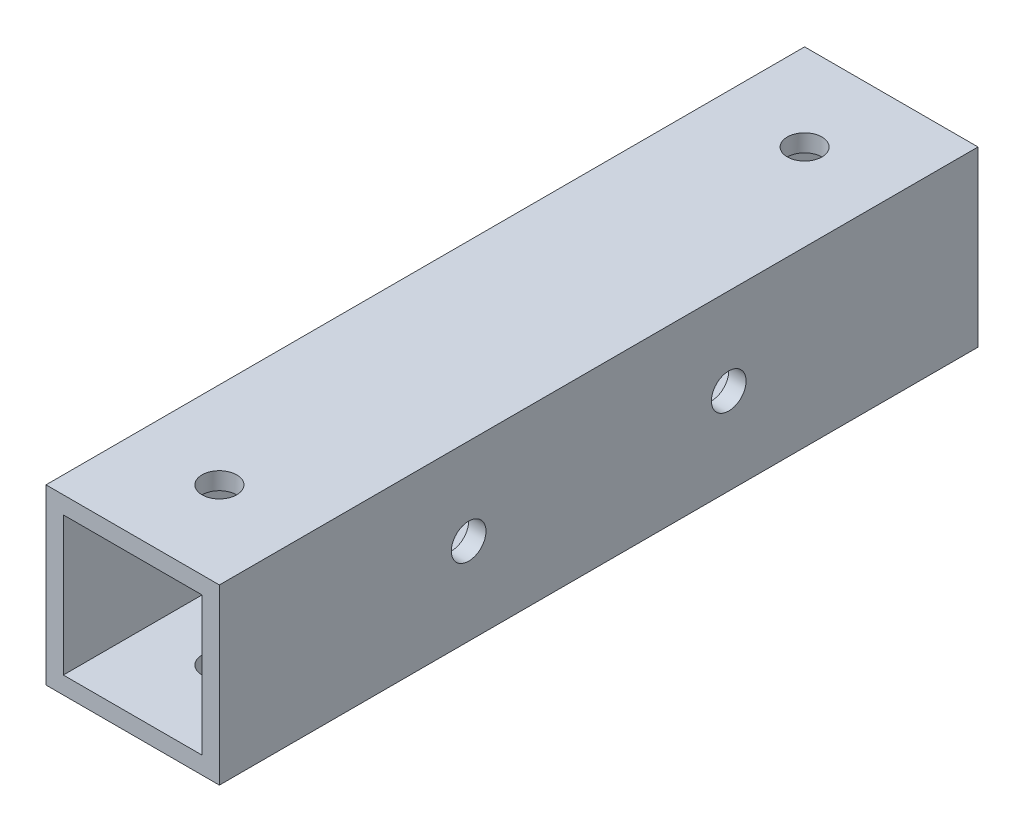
ISO-10303-21;
HEADER;
FILE_DESCRIPTION(('STEP AP214'),'2;1');
FILE_NAME('part.step','',(''),(''),'','','');
FILE_SCHEMA(('AUTOMOTIVE_DESIGN { 1 0 10303 214 1 1 1 1 }'));
ENDSEC;
DATA;
#1=APPLICATION_CONTEXT('core data for automotive mechanical design processes');
#2=APPLICATION_PROTOCOL_DEFINITION('international standard','automotive_design',2000,#1);
#3=PRODUCT_CONTEXT('',#1,'mechanical');
#4=PRODUCT('Part','Part','',(#3));
#5=PRODUCT_RELATED_PRODUCT_CATEGORY('part','',(#4));
#6=PRODUCT_DEFINITION_FORMATION('','',#4);
#7=PRODUCT_DEFINITION_CONTEXT('part definition',#1,'design');
#8=PRODUCT_DEFINITION('design','',#6,#7);
#9=PRODUCT_DEFINITION_SHAPE('','',#8);
#10=(LENGTH_UNIT() NAMED_UNIT(*) SI_UNIT(.MILLI.,.METRE.));
#11=(NAMED_UNIT(*) PLANE_ANGLE_UNIT() SI_UNIT($,.RADIAN.));
#12=(NAMED_UNIT(*) SI_UNIT($,.STERADIAN.) SOLID_ANGLE_UNIT());
#13=UNCERTAINTY_MEASURE_WITH_UNIT(LENGTH_MEASURE(1.E-05),#10,'distance_accuracy_value','');
#14=(GEOMETRIC_REPRESENTATION_CONTEXT(3) GLOBAL_UNCERTAINTY_ASSIGNED_CONTEXT((#13)) GLOBAL_UNIT_ASSIGNED_CONTEXT((#10,
#11,#12)) REPRESENTATION_CONTEXT('',''));
#15=CARTESIAN_POINT('',(0.,0.,0.));
#16=DIRECTION('',(0.,0.,1.));
#17=DIRECTION('',(1.,0.,0.));
#18=AXIS2_PLACEMENT_3D('',#15,#16,#17);
#19=CARTESIAN_POINT('',(0.,0.,87.5));
#20=DIRECTION('',(0.,0.,1.));
#21=DIRECTION('',(1.,0.,0.));
#22=AXIS2_PLACEMENT_3D('',#19,#20,#21);
#23=PLANE('',#22);
#24=DIRECTION('',(0.,1.,0.));
#25=VECTOR('',#24,1.);
#26=CARTESIAN_POINT('',(10.,10.,87.5));
#27=LINE('',#26,#25);
#28=CARTESIAN_POINT('',(10.,-10.,87.5));
#29=VERTEX_POINT('',#28);
#30=CARTESIAN_POINT('',(10.,10.,87.5));
#31=VERTEX_POINT('',#30);
#32=EDGE_CURVE('E140',#29,#31,#27,.T.);
#33=ORIENTED_EDGE('',*,*,#32,.T.);
#34=DIRECTION('',(-1.,0.,0.));
#35=VECTOR('',#34,1.);
#36=CARTESIAN_POINT('',(-10.,10.,87.5));
#37=LINE('',#36,#35);
#38=CARTESIAN_POINT('',(-10.,10.,87.5));
#39=VERTEX_POINT('',#38);
#40=EDGE_CURVE('E143',#31,#39,#37,.T.);
#41=ORIENTED_EDGE('',*,*,#40,.T.);
#42=DIRECTION('',(0.,-1.,0.));
#43=VECTOR('',#42,1.);
#44=CARTESIAN_POINT('',(-10.,10.,87.5));
#45=LINE('',#44,#43);
#46=CARTESIAN_POINT('',(-9.99999999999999,-10.,87.5));
#47=VERTEX_POINT('',#46);
#48=EDGE_CURVE('E146',#39,#47,#45,.T.);
#49=ORIENTED_EDGE('',*,*,#48,.T.);
#50=DIRECTION('',(1.,0.,0.));
#51=VECTOR('',#50,1.);
#52=CARTESIAN_POINT('',(-9.99999999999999,-10.,87.5));
#53=LINE('',#52,#51);
#54=EDGE_CURVE('E148',#47,#29,#53,.T.);
#55=ORIENTED_EDGE('',*,*,#54,.T.);
#56=EDGE_LOOP('',(#33,#41,#49,#55));
#57=FACE_BOUND('',#56,.T.);
#58=DIRECTION('',(1.,0.,0.));
#59=VECTOR('',#58,1.);
#60=CARTESIAN_POINT('',(-8.,-8.,87.5));
#61=LINE('',#60,#59);
#62=CARTESIAN_POINT('',(-8.,-8.,87.5));
#63=VERTEX_POINT('',#62);
#64=CARTESIAN_POINT('',(8.,-8.,87.5));
#65=VERTEX_POINT('',#64);
#66=EDGE_CURVE('E110',#63,#65,#61,.T.);
#67=ORIENTED_EDGE('',*,*,#66,.F.);
#68=DIRECTION('',(0.,-1.,0.));
#69=VECTOR('',#68,1.);
#70=CARTESIAN_POINT('',(-8.,8.,87.5));
#71=LINE('',#70,#69);
#72=CARTESIAN_POINT('',(-8.,8.,87.5));
#73=VERTEX_POINT('',#72);
#74=EDGE_CURVE('E102',#73,#63,#71,.T.);
#75=ORIENTED_EDGE('',*,*,#74,.F.);
#76=DIRECTION('',(-1.,0.,0.));
#77=VECTOR('',#76,1.);
#78=CARTESIAN_POINT('',(-8.,8.,87.5));
#79=LINE('',#78,#77);
#80=CARTESIAN_POINT('',(8.,8.,87.5));
#81=VERTEX_POINT('',#80);
#82=EDGE_CURVE('E124',#81,#73,#79,.T.);
#83=ORIENTED_EDGE('',*,*,#82,.F.);
#84=DIRECTION('',(0.,1.,0.));
#85=VECTOR('',#84,1.);
#86=CARTESIAN_POINT('',(8.,8.,87.5));
#87=LINE('',#86,#85);
#88=EDGE_CURVE('E122',#65,#81,#87,.T.);
#89=ORIENTED_EDGE('',*,*,#88,.F.);
#90=EDGE_LOOP('',(#67,#75,#83,#89));
#91=FACE_BOUND('',#90,.T.);
#92=ADVANCED_FACE('F35',(#57,#91),#23,.T.);
#93=CARTESIAN_POINT('',(0.,0.,0.));
#94=DIRECTION('',(0.,0.,1.));
#95=DIRECTION('',(1.,0.,0.));
#96=AXIS2_PLACEMENT_3D('',#93,#94,#95);
#97=PLANE('',#96);
#98=DIRECTION('',(0.,1.,0.));
#99=VECTOR('',#98,1.);
#100=CARTESIAN_POINT('',(10.,10.,0.));
#101=LINE('',#100,#99);
#102=CARTESIAN_POINT('',(10.,-10.,0.));
#103=VERTEX_POINT('',#102);
#104=CARTESIAN_POINT('',(10.,10.,0.));
#105=VERTEX_POINT('',#104);
#106=EDGE_CURVE('E118',#103,#105,#101,.T.);
#107=ORIENTED_EDGE('',*,*,#106,.F.);
#108=DIRECTION('',(1.,0.,0.));
#109=VECTOR('',#108,1.);
#110=CARTESIAN_POINT('',(-9.99999999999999,-10.,0.));
#111=LINE('',#110,#109);
#112=CARTESIAN_POINT('',(-9.99999999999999,-10.,0.));
#113=VERTEX_POINT('',#112);
#114=EDGE_CURVE('E144',#113,#103,#111,.T.);
#115=ORIENTED_EDGE('',*,*,#114,.F.);
#116=DIRECTION('',(0.,-1.,0.));
#117=VECTOR('',#116,1.);
#118=CARTESIAN_POINT('',(-10.,10.,0.));
#119=LINE('',#118,#117);
#120=CARTESIAN_POINT('',(-10.,10.,0.));
#121=VERTEX_POINT('',#120);
#122=EDGE_CURVE('E155',#121,#113,#119,.T.);
#123=ORIENTED_EDGE('',*,*,#122,.F.);
#124=DIRECTION('',(-1.,0.,0.));
#125=VECTOR('',#124,1.);
#126=CARTESIAN_POINT('',(-10.,10.,0.));
#127=LINE('',#126,#125);
#128=EDGE_CURVE('E153',#105,#121,#127,.T.);
#129=ORIENTED_EDGE('',*,*,#128,.F.);
#130=EDGE_LOOP('',(#107,#115,#123,#129));
#131=FACE_BOUND('',#130,.T.);
#132=DIRECTION('',(0.,-1.,0.));
#133=VECTOR('',#132,1.);
#134=CARTESIAN_POINT('',(-8.,8.,0.));
#135=LINE('',#134,#133);
#136=CARTESIAN_POINT('',(-8.,8.,0.));
#137=VERTEX_POINT('',#136);
#138=CARTESIAN_POINT('',(-8.,-8.,0.));
#139=VERTEX_POINT('',#138);
#140=EDGE_CURVE('E60',#137,#139,#135,.T.);
#141=ORIENTED_EDGE('',*,*,#140,.T.);
#142=DIRECTION('',(1.,0.,0.));
#143=VECTOR('',#142,1.);
#144=CARTESIAN_POINT('',(-8.,-8.,0.));
#145=LINE('',#144,#143);
#146=CARTESIAN_POINT('',(8.,-8.,0.));
#147=VERTEX_POINT('',#146);
#148=EDGE_CURVE('E117',#139,#147,#145,.T.);
#149=ORIENTED_EDGE('',*,*,#148,.T.);
#150=DIRECTION('',(0.,1.,0.));
#151=VECTOR('',#150,1.);
#152=CARTESIAN_POINT('',(8.,8.,0.));
#153=LINE('',#152,#151);
#154=CARTESIAN_POINT('',(8.,8.,0.));
#155=VERTEX_POINT('',#154);
#156=EDGE_CURVE('E132',#147,#155,#153,.T.);
#157=ORIENTED_EDGE('',*,*,#156,.T.);
#158=DIRECTION('',(-1.,0.,0.));
#159=VECTOR('',#158,1.);
#160=CARTESIAN_POINT('',(-8.,8.,0.));
#161=LINE('',#160,#159);
#162=EDGE_CURVE('E111',#155,#137,#161,.T.);
#163=ORIENTED_EDGE('',*,*,#162,.T.);
#164=EDGE_LOOP('',(#141,#149,#157,#163));
#165=FACE_BOUND('',#164,.T.);
#166=ADVANCED_FACE('F226',(#131,#165),#97,.F.);
#167=CARTESIAN_POINT('',(10.,10.,87.5));
#168=DIRECTION('',(-1.,0.,0.));
#169=DIRECTION('',(0.,-1.,0.));
#170=AXIS2_PLACEMENT_3D('',#167,#168,#169);
#171=PLANE('',#170);
#172=CARTESIAN_POINT('',(10.,0.,58.75));
#173=DIRECTION('',(1.,0.,0.));
#174=DIRECTION('',(0.,0.,-1.));
#175=AXIS2_PLACEMENT_3D('',#172,#173,#174);
#176=CIRCLE('',#175,1.99999999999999);
#177=CARTESIAN_POINT('',(10.,0.,56.75));
#178=VERTEX_POINT('',#177);
#179=EDGE_CURVE('E303',#178,#178,#176,.T.);
#180=ORIENTED_EDGE('',*,*,#179,.F.);
#181=EDGE_LOOP('',(#180));
#182=FACE_BOUND('',#181,.T.);
#183=CARTESIAN_POINT('',(10.,0.,28.75));
#184=DIRECTION('',(1.,0.,0.));
#185=DIRECTION('',(0.,0.,-1.));
#186=AXIS2_PLACEMENT_3D('',#183,#184,#185);
#187=CIRCLE('',#186,1.99999999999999);
#188=CARTESIAN_POINT('',(10.,0.,26.75));
#189=VERTEX_POINT('',#188);
#190=EDGE_CURVE('E183',#189,#189,#187,.T.);
#191=ORIENTED_EDGE('',*,*,#190,.F.);
#192=EDGE_LOOP('',(#191));
#193=FACE_BOUND('',#192,.T.);
#194=ORIENTED_EDGE('',*,*,#106,.T.);
#195=DIRECTION('',(0.,0.,-1.));
#196=VECTOR('',#195,1.);
#197=CARTESIAN_POINT('',(10.,10.,87.5));
#198=LINE('',#197,#196);
#199=EDGE_CURVE('E11',#31,#105,#198,.T.);
#200=ORIENTED_EDGE('',*,*,#199,.F.);
#201=ORIENTED_EDGE('',*,*,#32,.F.);
#202=DIRECTION('',(0.,0.,-1.));
#203=VECTOR('',#202,1.);
#204=CARTESIAN_POINT('',(10.,-10.,87.5));
#205=LINE('',#204,#203);
#206=EDGE_CURVE('E150',#29,#103,#205,.T.);
#207=ORIENTED_EDGE('',*,*,#206,.T.);
#208=EDGE_LOOP('',(#194,#200,#201,#207));
#209=FACE_BOUND('',#208,.T.);
#210=ADVANCED_FACE('F37',(#182,#193,#209),#171,.F.);
#211=CARTESIAN_POINT('',(-10.,10.,87.5));
#212=DIRECTION('',(0.,-1.,0.));
#213=DIRECTION('',(0.,0.,-1.));
#214=AXIS2_PLACEMENT_3D('',#211,#212,#213);
#215=PLANE('',#214);
#216=CARTESIAN_POINT('',(1.87350135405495E-13,10.,10.0000000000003));
#217=DIRECTION('',(0.,1.,0.));
#218=DIRECTION('',(0.,0.,1.));
#219=AXIS2_PLACEMENT_3D('',#216,#217,#218);
#220=CIRCLE('',#219,1.99999999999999);
#221=CARTESIAN_POINT('',(1.87350135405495E-13,10.,12.0000000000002));
#222=VERTEX_POINT('',#221);
#223=EDGE_CURVE('E180',#222,#222,#220,.T.);
#224=ORIENTED_EDGE('',*,*,#223,.F.);
#225=EDGE_LOOP('',(#224));
#226=FACE_BOUND('',#225,.T.);
#227=CARTESIAN_POINT('',(2.22044604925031E-13,10.,77.5000000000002));
#228=DIRECTION('',(0.,1.,0.));
#229=DIRECTION('',(0.,0.,1.));
#230=AXIS2_PLACEMENT_3D('',#227,#228,#229);
#231=CIRCLE('',#230,1.99999999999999);
#232=CARTESIAN_POINT('',(2.22044604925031E-13,10.,79.5000000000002));
#233=VERTEX_POINT('',#232);
#234=EDGE_CURVE('E198',#233,#233,#231,.T.);
#235=ORIENTED_EDGE('',*,*,#234,.F.);
#236=EDGE_LOOP('',(#235));
#237=FACE_BOUND('',#236,.T.);
#238=ORIENTED_EDGE('',*,*,#128,.T.);
#239=DIRECTION('',(0.,0.,-1.));
#240=VECTOR('',#239,1.);
#241=CARTESIAN_POINT('',(-10.,10.,87.5));
#242=LINE('',#241,#240);
#243=EDGE_CURVE('E44',#39,#121,#242,.T.);
#244=ORIENTED_EDGE('',*,*,#243,.F.);
#245=ORIENTED_EDGE('',*,*,#40,.F.);
#246=ORIENTED_EDGE('',*,*,#199,.T.);
#247=EDGE_LOOP('',(#238,#244,#245,#246));
#248=FACE_BOUND('',#247,.T.);
#249=ADVANCED_FACE('F239',(#226,#237,#248),#215,.F.);
#250=CARTESIAN_POINT('',(-10.,10.,87.5));
#251=DIRECTION('',(1.,0.,0.));
#252=DIRECTION('',(0.,1.,0.));
#253=AXIS2_PLACEMENT_3D('',#250,#251,#252);
#254=PLANE('',#253);
#255=CARTESIAN_POINT('',(-10.,0.,58.75));
#256=DIRECTION('',(1.,0.,0.));
#257=DIRECTION('',(0.,0.,-1.));
#258=AXIS2_PLACEMENT_3D('',#255,#256,#257);
#259=CIRCLE('',#258,2.);
#260=CARTESIAN_POINT('',(-10.,0.,56.75));
#261=VERTEX_POINT('',#260);
#262=EDGE_CURVE('E304',#261,#261,#259,.T.);
#263=ORIENTED_EDGE('',*,*,#262,.T.);
#264=EDGE_LOOP('',(#263));
#265=FACE_BOUND('',#264,.T.);
#266=CARTESIAN_POINT('',(-10.,0.,28.75));
#267=DIRECTION('',(1.,0.,0.));
#268=DIRECTION('',(0.,0.,-1.));
#269=AXIS2_PLACEMENT_3D('',#266,#267,#268);
#270=CIRCLE('',#269,2.);
#271=CARTESIAN_POINT('',(-10.,0.,26.75));
#272=VERTEX_POINT('',#271);
#273=EDGE_CURVE('E176',#272,#272,#270,.T.);
#274=ORIENTED_EDGE('',*,*,#273,.T.);
#275=EDGE_LOOP('',(#274));
#276=FACE_BOUND('',#275,.T.);
#277=ORIENTED_EDGE('',*,*,#122,.T.);
#278=DIRECTION('',(0.,0.,-1.));
#279=VECTOR('',#278,1.);
#280=CARTESIAN_POINT('',(-9.99999999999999,-10.,87.5));
#281=LINE('',#280,#279);
#282=EDGE_CURVE('E160',#47,#113,#281,.T.);
#283=ORIENTED_EDGE('',*,*,#282,.F.);
#284=ORIENTED_EDGE('',*,*,#48,.F.);
#285=ORIENTED_EDGE('',*,*,#243,.T.);
#286=EDGE_LOOP('',(#277,#283,#284,#285));
#287=FACE_BOUND('',#286,.T.);
#288=ADVANCED_FACE('F236',(#265,#276,#287),#254,.F.);
#289=CARTESIAN_POINT('',(-9.99999999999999,-10.,87.5));
#290=DIRECTION('',(0.,1.,0.));
#291=DIRECTION('',(0.,0.,1.));
#292=AXIS2_PLACEMENT_3D('',#289,#290,#291);
#293=PLANE('',#292);
#294=CARTESIAN_POINT('',(1.87350135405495E-13,-10.,10.0000000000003));
#295=DIRECTION('',(0.,1.,0.));
#296=DIRECTION('',(0.,0.,1.));
#297=AXIS2_PLACEMENT_3D('',#294,#295,#296);
#298=CIRCLE('',#297,2.);
#299=CARTESIAN_POINT('',(1.87350135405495E-13,-10.,12.0000000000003));
#300=VERTEX_POINT('',#299);
#301=EDGE_CURVE('E172',#300,#300,#298,.T.);
#302=ORIENTED_EDGE('',*,*,#301,.T.);
#303=EDGE_LOOP('',(#302));
#304=FACE_BOUND('',#303,.T.);
#305=CARTESIAN_POINT('',(2.22044604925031E-13,-10.,77.5000000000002));
#306=DIRECTION('',(0.,1.,0.));
#307=DIRECTION('',(0.,0.,1.));
#308=AXIS2_PLACEMENT_3D('',#305,#306,#307);
#309=CIRCLE('',#308,2.);
#310=CARTESIAN_POINT('',(2.22044604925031E-13,-10.,79.5000000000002));
#311=VERTEX_POINT('',#310);
#312=EDGE_CURVE('E168',#311,#311,#309,.T.);
#313=ORIENTED_EDGE('',*,*,#312,.T.);
#314=EDGE_LOOP('',(#313));
#315=FACE_BOUND('',#314,.T.);
#316=ORIENTED_EDGE('',*,*,#114,.T.);
#317=ORIENTED_EDGE('',*,*,#206,.F.);
#318=ORIENTED_EDGE('',*,*,#54,.F.);
#319=ORIENTED_EDGE('',*,*,#282,.T.);
#320=EDGE_LOOP('',(#316,#317,#318,#319));
#321=FACE_BOUND('',#320,.T.);
#322=ADVANCED_FACE('F221',(#304,#315,#321),#293,.F.);
#323=CARTESIAN_POINT('',(-8.,8.,87.5));
#324=DIRECTION('',(1.,0.,0.));
#325=DIRECTION('',(0.,0.,-1.));
#326=AXIS2_PLACEMENT_3D('',#323,#324,#325);
#327=PLANE('',#326);
#328=CARTESIAN_POINT('',(-8.,0.,58.75));
#329=DIRECTION('',(1.,0.,0.));
#330=DIRECTION('',(0.,0.,-1.));
#331=AXIS2_PLACEMENT_3D('',#328,#329,#330);
#332=CIRCLE('',#331,1.99999999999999);
#333=CARTESIAN_POINT('',(-8.,0.,56.75));
#334=VERTEX_POINT('',#333);
#335=EDGE_CURVE('E188',#334,#334,#332,.T.);
#336=ORIENTED_EDGE('',*,*,#335,.F.);
#337=EDGE_LOOP('',(#336));
#338=FACE_BOUND('',#337,.T.);
#339=CARTESIAN_POINT('',(-8.,0.,28.75));
#340=DIRECTION('',(1.,0.,0.));
#341=DIRECTION('',(0.,0.,-1.));
#342=AXIS2_PLACEMENT_3D('',#339,#340,#341);
#343=CIRCLE('',#342,1.99999999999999);
#344=CARTESIAN_POINT('',(-8.,0.,26.75));
#345=VERTEX_POINT('',#344);
#346=EDGE_CURVE('E175',#345,#345,#343,.T.);
#347=ORIENTED_EDGE('',*,*,#346,.F.);
#348=EDGE_LOOP('',(#347));
#349=FACE_BOUND('',#348,.T.);
#350=ORIENTED_EDGE('',*,*,#140,.F.);
#351=DIRECTION('',(0.,0.,-1.));
#352=VECTOR('',#351,1.);
#353=CARTESIAN_POINT('',(-8.,8.,87.5));
#354=LINE('',#353,#352);
#355=EDGE_CURVE('E106',#73,#137,#354,.T.);
#356=ORIENTED_EDGE('',*,*,#355,.F.);
#357=ORIENTED_EDGE('',*,*,#74,.T.);
#358=DIRECTION('',(0.,0.,-1.));
#359=VECTOR('',#358,1.);
#360=CARTESIAN_POINT('',(-8.,-8.,87.5));
#361=LINE('',#360,#359);
#362=EDGE_CURVE('E105',#63,#139,#361,.T.);
#363=ORIENTED_EDGE('',*,*,#362,.T.);
#364=EDGE_LOOP('',(#350,#356,#357,#363));
#365=FACE_BOUND('',#364,.T.);
#366=ADVANCED_FACE('F104',(#338,#349,#365),#327,.T.);
#367=CARTESIAN_POINT('',(-8.,-8.,87.5));
#368=DIRECTION('',(0.,1.,0.));
#369=DIRECTION('',(-1.,0.,0.));
#370=AXIS2_PLACEMENT_3D('',#367,#368,#369);
#371=PLANE('',#370);
#372=CARTESIAN_POINT('',(1.87350135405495E-13,-8.,10.0000000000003));
#373=DIRECTION('',(0.,1.,0.));
#374=DIRECTION('',(-1.,0.,0.));
#375=AXIS2_PLACEMENT_3D('',#372,#373,#374);
#376=CIRCLE('',#375,1.99999999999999);
#377=CARTESIAN_POINT('',(-1.99999999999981,-8.,10.0000000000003));
#378=VERTEX_POINT('',#377);
#379=EDGE_CURVE('E171',#378,#378,#376,.T.);
#380=ORIENTED_EDGE('',*,*,#379,.F.);
#381=EDGE_LOOP('',(#380));
#382=FACE_BOUND('',#381,.T.);
#383=CARTESIAN_POINT('',(2.22044604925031E-13,-8.,77.5000000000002));
#384=DIRECTION('',(0.,1.,0.));
#385=DIRECTION('',(-1.,0.,0.));
#386=AXIS2_PLACEMENT_3D('',#383,#384,#385);
#387=CIRCLE('',#386,1.99999999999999);
#388=CARTESIAN_POINT('',(-1.99999999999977,-8.,77.5000000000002));
#389=VERTEX_POINT('',#388);
#390=EDGE_CURVE('E130',#389,#389,#387,.T.);
#391=ORIENTED_EDGE('',*,*,#390,.F.);
#392=EDGE_LOOP('',(#391));
#393=FACE_BOUND('',#392,.T.);
#394=ORIENTED_EDGE('',*,*,#148,.F.);
#395=ORIENTED_EDGE('',*,*,#362,.F.);
#396=ORIENTED_EDGE('',*,*,#66,.T.);
#397=DIRECTION('',(0.,0.,-1.));
#398=VECTOR('',#397,1.);
#399=CARTESIAN_POINT('',(8.,-8.,87.5));
#400=LINE('',#399,#398);
#401=EDGE_CURVE('E119',#65,#147,#400,.T.);
#402=ORIENTED_EDGE('',*,*,#401,.T.);
#403=EDGE_LOOP('',(#394,#395,#396,#402));
#404=FACE_BOUND('',#403,.T.);
#405=ADVANCED_FACE('F114',(#382,#393,#404),#371,.T.);
#406=CARTESIAN_POINT('',(8.,8.,87.5));
#407=DIRECTION('',(-1.,0.,0.));
#408=DIRECTION('',(0.,0.,1.));
#409=AXIS2_PLACEMENT_3D('',#406,#407,#408);
#410=PLANE('',#409);
#411=CARTESIAN_POINT('',(8.,0.,58.75));
#412=DIRECTION('',(-1.,0.,0.));
#413=DIRECTION('',(0.,0.,1.));
#414=AXIS2_PLACEMENT_3D('',#411,#412,#413);
#415=CIRCLE('',#414,1.99999999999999);
#416=CARTESIAN_POINT('',(8.,0.,60.75));
#417=VERTEX_POINT('',#416);
#418=EDGE_CURVE('E39',#417,#417,#415,.T.);
#419=ORIENTED_EDGE('',*,*,#418,.F.);
#420=EDGE_LOOP('',(#419));
#421=FACE_BOUND('',#420,.T.);
#422=CARTESIAN_POINT('',(8.,0.,28.75));
#423=DIRECTION('',(-1.,0.,0.));
#424=DIRECTION('',(0.,0.,1.));
#425=AXIS2_PLACEMENT_3D('',#422,#423,#424);
#426=CIRCLE('',#425,1.99999999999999);
#427=CARTESIAN_POINT('',(8.,0.,30.75));
#428=VERTEX_POINT('',#427);
#429=EDGE_CURVE('E173',#428,#428,#426,.T.);
#430=ORIENTED_EDGE('',*,*,#429,.F.);
#431=EDGE_LOOP('',(#430));
#432=FACE_BOUND('',#431,.T.);
#433=ORIENTED_EDGE('',*,*,#156,.F.);
#434=ORIENTED_EDGE('',*,*,#401,.F.);
#435=ORIENTED_EDGE('',*,*,#88,.T.);
#436=DIRECTION('',(0.,0.,-1.));
#437=VECTOR('',#436,1.);
#438=CARTESIAN_POINT('',(8.,8.,87.5));
#439=LINE('',#438,#437);
#440=EDGE_CURVE('E52',#81,#155,#439,.T.);
#441=ORIENTED_EDGE('',*,*,#440,.T.);
#442=EDGE_LOOP('',(#433,#434,#435,#441));
#443=FACE_BOUND('',#442,.T.);
#444=ADVANCED_FACE('F209',(#421,#432,#443),#410,.T.);
#445=CARTESIAN_POINT('',(-8.,8.,87.5));
#446=DIRECTION('',(0.,-1.,0.));
#447=DIRECTION('',(0.,0.,-1.));
#448=AXIS2_PLACEMENT_3D('',#445,#446,#447);
#449=PLANE('',#448);
#450=CARTESIAN_POINT('',(1.87350135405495E-13,8.,10.0000000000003));
#451=DIRECTION('',(0.,-1.,0.));
#452=DIRECTION('',(0.,0.,-1.));
#453=AXIS2_PLACEMENT_3D('',#450,#451,#452);
#454=CIRCLE('',#453,1.99999999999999);
#455=CARTESIAN_POINT('',(1.87350135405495E-13,8.,8.00000000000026));
#456=VERTEX_POINT('',#455);
#457=EDGE_CURVE('E169',#456,#456,#454,.T.);
#458=ORIENTED_EDGE('',*,*,#457,.F.);
#459=EDGE_LOOP('',(#458));
#460=FACE_BOUND('',#459,.T.);
#461=CARTESIAN_POINT('',(2.22044604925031E-13,8.,77.5000000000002));
#462=DIRECTION('',(0.,-1.,0.));
#463=DIRECTION('',(0.,0.,-1.));
#464=AXIS2_PLACEMENT_3D('',#461,#462,#463);
#465=CIRCLE('',#464,1.99999999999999);
#466=CARTESIAN_POINT('',(2.22044604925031E-13,8.,75.5000000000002));
#467=VERTEX_POINT('',#466);
#468=EDGE_CURVE('E165',#467,#467,#465,.T.);
#469=ORIENTED_EDGE('',*,*,#468,.F.);
#470=EDGE_LOOP('',(#469));
#471=FACE_BOUND('',#470,.T.);
#472=ORIENTED_EDGE('',*,*,#162,.F.);
#473=ORIENTED_EDGE('',*,*,#440,.F.);
#474=ORIENTED_EDGE('',*,*,#82,.T.);
#475=ORIENTED_EDGE('',*,*,#355,.T.);
#476=EDGE_LOOP('',(#472,#473,#474,#475));
#477=FACE_BOUND('',#476,.T.);
#478=ADVANCED_FACE('F217',(#460,#471,#477),#449,.T.);
#479=CARTESIAN_POINT('',(2.22044604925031E-13,10.,77.5000000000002));
#480=DIRECTION('',(0.,1.,0.));
#481=DIRECTION('',(0.,0.,1.));
#482=AXIS2_PLACEMENT_3D('',#479,#480,#481);
#483=CYLINDRICAL_SURFACE('',#482,1.99999999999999);
#484=ORIENTED_EDGE('',*,*,#468,.T.);
#485=EDGE_LOOP('',(#484));
#486=FACE_BOUND('',#485,.T.);
#487=ORIENTED_EDGE('',*,*,#234,.T.);
#488=EDGE_LOOP('',(#487));
#489=FACE_BOUND('',#488,.T.);
#490=ADVANCED_FACE('F267',(#486,#489),#483,.F.);
#491=ORIENTED_EDGE('',*,*,#390,.T.);
#492=EDGE_LOOP('',(#491));
#493=FACE_BOUND('',#492,.T.);
#494=ORIENTED_EDGE('',*,*,#312,.F.);
#495=EDGE_LOOP('',(#494));
#496=FACE_BOUND('',#495,.T.);
#497=ADVANCED_FACE('F205',(#493,#496),#483,.F.);
#498=CARTESIAN_POINT('',(1.87350135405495E-13,10.,10.0000000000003));
#499=DIRECTION('',(0.,1.,0.));
#500=DIRECTION('',(0.,0.,1.));
#501=AXIS2_PLACEMENT_3D('',#498,#499,#500);
#502=CYLINDRICAL_SURFACE('',#501,1.99999999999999);
#503=ORIENTED_EDGE('',*,*,#457,.T.);
#504=EDGE_LOOP('',(#503));
#505=FACE_BOUND('',#504,.T.);
#506=ORIENTED_EDGE('',*,*,#223,.T.);
#507=EDGE_LOOP('',(#506));
#508=FACE_BOUND('',#507,.T.);
#509=ADVANCED_FACE('F279',(#505,#508),#502,.F.);
#510=ORIENTED_EDGE('',*,*,#379,.T.);
#511=EDGE_LOOP('',(#510));
#512=FACE_BOUND('',#511,.T.);
#513=ORIENTED_EDGE('',*,*,#301,.F.);
#514=EDGE_LOOP('',(#513));
#515=FACE_BOUND('',#514,.T.);
#516=ADVANCED_FACE('F282',(#512,#515),#502,.F.);
#517=CARTESIAN_POINT('',(10.,0.,28.75));
#518=DIRECTION('',(1.,0.,0.));
#519=DIRECTION('',(0.,0.,-1.));
#520=AXIS2_PLACEMENT_3D('',#517,#518,#519);
#521=CYLINDRICAL_SURFACE('',#520,1.99999999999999);
#522=ORIENTED_EDGE('',*,*,#429,.T.);
#523=EDGE_LOOP('',(#522));
#524=FACE_BOUND('',#523,.T.);
#525=ORIENTED_EDGE('',*,*,#190,.T.);
#526=EDGE_LOOP('',(#525));
#527=FACE_BOUND('',#526,.T.);
#528=ADVANCED_FACE('F284',(#524,#527),#521,.F.);
#529=ORIENTED_EDGE('',*,*,#346,.T.);
#530=EDGE_LOOP('',(#529));
#531=FACE_BOUND('',#530,.T.);
#532=ORIENTED_EDGE('',*,*,#273,.F.);
#533=EDGE_LOOP('',(#532));
#534=FACE_BOUND('',#533,.T.);
#535=ADVANCED_FACE('F287',(#531,#534),#521,.F.);
#536=CARTESIAN_POINT('',(10.,0.,58.75));
#537=DIRECTION('',(1.,0.,0.));
#538=DIRECTION('',(0.,0.,-1.));
#539=AXIS2_PLACEMENT_3D('',#536,#537,#538);
#540=CYLINDRICAL_SURFACE('',#539,1.99999999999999);
#541=ORIENTED_EDGE('',*,*,#418,.T.);
#542=EDGE_LOOP('',(#541));
#543=FACE_BOUND('',#542,.T.);
#544=ORIENTED_EDGE('',*,*,#179,.T.);
#545=EDGE_LOOP('',(#544));
#546=FACE_BOUND('',#545,.T.);
#547=ADVANCED_FACE('F288',(#543,#546),#540,.F.);
#548=ORIENTED_EDGE('',*,*,#335,.T.);
#549=EDGE_LOOP('',(#548));
#550=FACE_BOUND('',#549,.T.);
#551=ORIENTED_EDGE('',*,*,#262,.F.);
#552=EDGE_LOOP('',(#551));
#553=FACE_BOUND('',#552,.T.);
#554=ADVANCED_FACE('F290',(#550,#553),#540,.F.);
#555=CLOSED_SHELL('',(#92,#166,#210,#249,#288,#322,#366,#405,#444,#478,#490,#497,#509,#516,#528,
#535,#547,#554));
#556=MANIFOLD_SOLID_BREP('B2',#555);
#557=ADVANCED_BREP_SHAPE_REPRESENTATION('',(#18,#556),#14);
#558=SHAPE_DEFINITION_REPRESENTATION(#9,#557);
ENDSEC;
END-ISO-10303-21;
